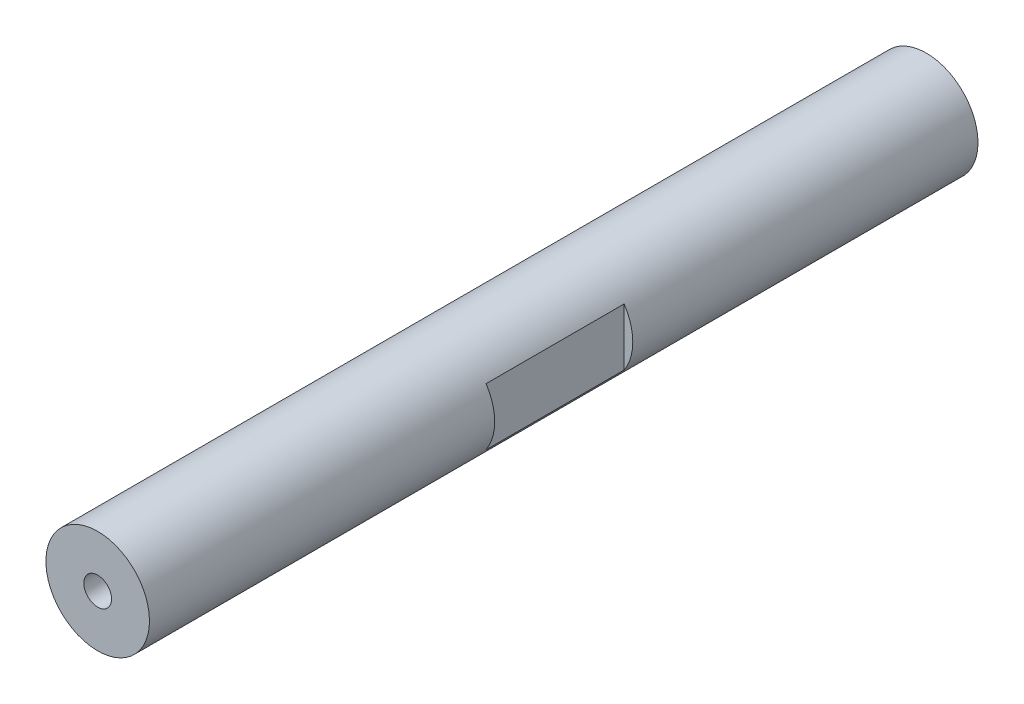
ISO-10303-21;
HEADER;
FILE_DESCRIPTION(('STEP AP214'),'2;1');
FILE_NAME('part.step','',(''),(''),'','','');
FILE_SCHEMA(('AUTOMOTIVE_DESIGN { 1 0 10303 214 1 1 1 1 }'));
ENDSEC;
DATA;
#1=APPLICATION_CONTEXT('core data for automotive mechanical design processes');
#2=APPLICATION_PROTOCOL_DEFINITION('international standard','automotive_design',2000,#1);
#3=PRODUCT_CONTEXT('',#1,'mechanical');
#4=PRODUCT('Part','Part','',(#3));
#5=PRODUCT_RELATED_PRODUCT_CATEGORY('part','',(#4));
#6=PRODUCT_DEFINITION_FORMATION('','',#4);
#7=PRODUCT_DEFINITION_CONTEXT('part definition',#1,'design');
#8=PRODUCT_DEFINITION('design','',#6,#7);
#9=PRODUCT_DEFINITION_SHAPE('','',#8);
#10=(LENGTH_UNIT() NAMED_UNIT(*) SI_UNIT(.MILLI.,.METRE.));
#11=(NAMED_UNIT(*) PLANE_ANGLE_UNIT() SI_UNIT($,.RADIAN.));
#12=(NAMED_UNIT(*) SI_UNIT($,.STERADIAN.) SOLID_ANGLE_UNIT());
#13=UNCERTAINTY_MEASURE_WITH_UNIT(LENGTH_MEASURE(1.E-05),#10,'distance_accuracy_value','');
#14=(GEOMETRIC_REPRESENTATION_CONTEXT(3) GLOBAL_UNCERTAINTY_ASSIGNED_CONTEXT((#13)) GLOBAL_UNIT_ASSIGNED_CONTEXT((#10,
#11,#12)) REPRESENTATION_CONTEXT('',''));
#15=CARTESIAN_POINT('',(0.,0.,0.));
#16=DIRECTION('',(0.,0.,1.));
#17=DIRECTION('',(1.,0.,0.));
#18=AXIS2_PLACEMENT_3D('',#15,#16,#17);
#19=CARTESIAN_POINT('',(0.,0.,76.2));
#20=DIRECTION('',(0.,0.,-1.));
#21=DIRECTION('',(-1.,0.,0.));
#22=AXIS2_PLACEMENT_3D('',#19,#20,#21);
#23=CYLINDRICAL_SURFACE('',#22,9.525);
#24=DIRECTION('',(0.,0.,-1.));
#25=VECTOR('',#24,1.);
#26=CARTESIAN_POINT('',(7.9375,5.26514185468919,76.2));
#27=LINE('',#26,#25);
#28=CARTESIAN_POINT('',(7.9375,5.26514185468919,12.7));
#29=VERTEX_POINT('',#28);
#30=CARTESIAN_POINT('',(7.9375,5.26514185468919,-12.7));
#31=VERTEX_POINT('',#30);
#32=EDGE_CURVE('E50',#29,#31,#27,.T.);
#33=ORIENTED_EDGE('',*,*,#32,.T.);
#34=CARTESIAN_POINT('',(0.,0.,-12.7));
#35=DIRECTION('',(0.,0.,-1.));
#36=DIRECTION('',(-1.,0.,0.));
#37=AXIS2_PLACEMENT_3D('',#34,#35,#36);
#38=CIRCLE('',#37,9.525);
#39=CARTESIAN_POINT('',(7.9375,-5.26514185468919,-12.7));
#40=VERTEX_POINT('',#39);
#41=EDGE_CURVE('E11',#31,#40,#38,.T.);
#42=ORIENTED_EDGE('',*,*,#41,.T.);
#43=DIRECTION('',(0.,0.,-1.));
#44=VECTOR('',#43,1.);
#45=CARTESIAN_POINT('',(7.9375,-5.26514185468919,76.2));
#46=LINE('',#45,#44);
#47=CARTESIAN_POINT('',(7.9375,-5.26514185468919,12.7));
#48=VERTEX_POINT('',#47);
#49=EDGE_CURVE('E126',#40,#48,#46,.F.);
#50=ORIENTED_EDGE('',*,*,#49,.T.);
#51=CARTESIAN_POINT('',(0.,0.,12.7));
#52=DIRECTION('',(0.,0.,1.));
#53=DIRECTION('',(1.,0.,0.));
#54=AXIS2_PLACEMENT_3D('',#51,#52,#53);
#55=CIRCLE('',#54,9.525);
#56=EDGE_CURVE('E119',#48,#29,#55,.T.);
#57=ORIENTED_EDGE('',*,*,#56,.T.);
#58=EDGE_LOOP('',(#33,#42,#50,#57));
#59=FACE_BOUND('',#58,.T.);
#60=DIRECTION('',(0.,0.,-1.));
#61=VECTOR('',#60,1.);
#62=CARTESIAN_POINT('',(-7.93749999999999,5.26514185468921,76.2));
#63=LINE('',#62,#61);
#64=CARTESIAN_POINT('',(-7.93749999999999,5.26514185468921,-12.7));
#65=VERTEX_POINT('',#64);
#66=CARTESIAN_POINT('',(-7.93749999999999,5.26514185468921,12.7));
#67=VERTEX_POINT('',#66);
#68=EDGE_CURVE('E101',#65,#67,#63,.F.);
#69=ORIENTED_EDGE('',*,*,#68,.T.);
#70=CARTESIAN_POINT('',(0.,0.,12.7));
#71=DIRECTION('',(0.,0.,1.));
#72=DIRECTION('',(1.,0.,0.));
#73=AXIS2_PLACEMENT_3D('',#70,#71,#72);
#74=CIRCLE('',#73,9.525);
#75=CARTESIAN_POINT('',(-7.93749999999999,-5.26514185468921,12.7));
#76=VERTEX_POINT('',#75);
#77=EDGE_CURVE('E114',#67,#76,#74,.T.);
#78=ORIENTED_EDGE('',*,*,#77,.T.);
#79=DIRECTION('',(0.,0.,-1.));
#80=VECTOR('',#79,1.);
#81=CARTESIAN_POINT('',(-7.93749999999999,-5.26514185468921,76.2));
#82=LINE('',#81,#80);
#83=CARTESIAN_POINT('',(-7.93749999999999,-5.26514185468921,-12.7));
#84=VERTEX_POINT('',#83);
#85=EDGE_CURVE('E107',#76,#84,#82,.T.);
#86=ORIENTED_EDGE('',*,*,#85,.T.);
#87=CARTESIAN_POINT('',(0.,0.,-12.7));
#88=DIRECTION('',(0.,0.,-1.));
#89=DIRECTION('',(-1.,0.,0.));
#90=AXIS2_PLACEMENT_3D('',#87,#88,#89);
#91=CIRCLE('',#90,9.525);
#92=EDGE_CURVE('E92',#84,#65,#91,.T.);
#93=ORIENTED_EDGE('',*,*,#92,.T.);
#94=EDGE_LOOP('',(#69,#78,#86,#93));
#95=FACE_BOUND('',#94,.T.);
#96=CARTESIAN_POINT('',(0.,0.,76.2));
#97=DIRECTION('',(0.,0.,1.));
#98=DIRECTION('',(1.,0.,0.));
#99=AXIS2_PLACEMENT_3D('',#96,#97,#98);
#100=CIRCLE('',#99,9.525);
#101=CARTESIAN_POINT('',(9.525,0.,76.2));
#102=VERTEX_POINT('',#101);
#103=EDGE_CURVE('E102',#102,#102,#100,.T.);
#104=ORIENTED_EDGE('',*,*,#103,.F.);
#105=EDGE_LOOP('',(#104));
#106=FACE_BOUND('',#105,.T.);
#107=CARTESIAN_POINT('',(0.,0.,-76.2));
#108=DIRECTION('',(0.,0.,1.));
#109=DIRECTION('',(1.,0.,0.));
#110=AXIS2_PLACEMENT_3D('',#107,#108,#109);
#111=CIRCLE('',#110,9.525);
#112=CARTESIAN_POINT('',(9.525,0.,-76.2));
#113=VERTEX_POINT('',#112);
#114=EDGE_CURVE('E165',#113,#113,#111,.T.);
#115=ORIENTED_EDGE('',*,*,#114,.T.);
#116=EDGE_LOOP('',(#115));
#117=FACE_BOUND('',#116,.T.);
#118=ADVANCED_FACE('F42',(#59,#95,#106,#117),#23,.T.);
#119=CARTESIAN_POINT('',(0.,0.,76.2));
#120=DIRECTION('',(0.,0.,1.));
#121=DIRECTION('',(1.,0.,0.));
#122=AXIS2_PLACEMENT_3D('',#119,#120,#121);
#123=PLANE('',#122);
#124=CARTESIAN_POINT('',(0.,0.,76.2));
#125=DIRECTION('',(0.,0.,1.));
#126=DIRECTION('',(1.,0.,0.));
#127=AXIS2_PLACEMENT_3D('',#124,#125,#126);
#128=CIRCLE('',#127,2.55269999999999);
#129=CARTESIAN_POINT('',(2.55269999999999,0.,76.2));
#130=VERTEX_POINT('',#129);
#131=EDGE_CURVE('E158',#130,#130,#128,.T.);
#132=ORIENTED_EDGE('',*,*,#131,.F.);
#133=EDGE_LOOP('',(#132));
#134=FACE_BOUND('',#133,.T.);
#135=ORIENTED_EDGE('',*,*,#103,.T.);
#136=EDGE_LOOP('',(#135));
#137=FACE_BOUND('',#136,.T.);
#138=ADVANCED_FACE('F177',(#134,#137),#123,.T.);
#139=CARTESIAN_POINT('',(0.,0.,-76.2));
#140=DIRECTION('',(0.,0.,1.));
#141=DIRECTION('',(1.,0.,0.));
#142=AXIS2_PLACEMENT_3D('',#139,#140,#141);
#143=PLANE('',#142);
#144=CARTESIAN_POINT('',(0.,0.,-76.2));
#145=DIRECTION('',(0.,0.,-1.));
#146=DIRECTION('',(-1.,0.,0.));
#147=AXIS2_PLACEMENT_3D('',#144,#145,#146);
#148=CIRCLE('',#147,2.55269999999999);
#149=CARTESIAN_POINT('',(-2.55269999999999,0.,-76.2));
#150=VERTEX_POINT('',#149);
#151=EDGE_CURVE('E146',#150,#150,#148,.T.);
#152=ORIENTED_EDGE('',*,*,#151,.F.);
#153=EDGE_LOOP('',(#152));
#154=FACE_BOUND('',#153,.T.);
#155=ORIENTED_EDGE('',*,*,#114,.F.);
#156=EDGE_LOOP('',(#155));
#157=FACE_BOUND('',#156,.T.);
#158=ADVANCED_FACE('F174',(#154,#157),#143,.F.);
#159=CARTESIAN_POINT('',(0.,0.,44.45));
#160=DIRECTION('',(0.,0.,1.));
#161=DIRECTION('',(1.,0.,0.));
#162=AXIS2_PLACEMENT_3D('',#159,#160,#161);
#163=CONICAL_SURFACE('',#162,2.55269999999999,1.02974425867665);
#164=CARTESIAN_POINT('',(0.,0.,42.9161830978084));
#165=VERTEX_POINT('',#164);
#166=VERTEX_LOOP('',#165);
#167=FACE_BOUND('',#166,.T.);
#168=CARTESIAN_POINT('',(0.,0.,44.45));
#169=DIRECTION('',(0.,0.,1.));
#170=DIRECTION('',(1.,0.,0.));
#171=AXIS2_PLACEMENT_3D('',#168,#169,#170);
#172=CIRCLE('',#171,2.55269999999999);
#173=CARTESIAN_POINT('',(2.55269999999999,0.,44.45));
#174=VERTEX_POINT('',#173);
#175=EDGE_CURVE('E162',#174,#174,#172,.T.);
#176=ORIENTED_EDGE('',*,*,#175,.T.);
#177=EDGE_LOOP('',(#176));
#178=FACE_BOUND('',#177,.T.);
#179=ADVANCED_FACE('F176',(#167,#178),#163,.F.);
#180=CARTESIAN_POINT('',(0.,0.,76.2));
#181=DIRECTION('',(0.,0.,1.));
#182=DIRECTION('',(1.,0.,0.));
#183=AXIS2_PLACEMENT_3D('',#180,#181,#182);
#184=CYLINDRICAL_SURFACE('',#183,2.55269999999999);
#185=ORIENTED_EDGE('',*,*,#175,.F.);
#186=EDGE_LOOP('',(#185));
#187=FACE_BOUND('',#186,.T.);
#188=ORIENTED_EDGE('',*,*,#131,.T.);
#189=EDGE_LOOP('',(#188));
#190=FACE_BOUND('',#189,.T.);
#191=ADVANCED_FACE('F183',(#187,#190),#184,.F.);
#192=CARTESIAN_POINT('',(0.,0.,-44.45));
#193=DIRECTION('',(0.,0.,-1.));
#194=DIRECTION('',(-1.,0.,0.));
#195=AXIS2_PLACEMENT_3D('',#192,#193,#194);
#196=CONICAL_SURFACE('',#195,2.55269999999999,1.02974425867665);
#197=CARTESIAN_POINT('',(0.,0.,-42.9161830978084));
#198=VERTEX_POINT('',#197);
#199=VERTEX_LOOP('',#198);
#200=FACE_BOUND('',#199,.T.);
#201=CARTESIAN_POINT('',(0.,0.,-44.45));
#202=DIRECTION('',(0.,0.,-1.));
#203=DIRECTION('',(-1.,0.,0.));
#204=AXIS2_PLACEMENT_3D('',#201,#202,#203);
#205=CIRCLE('',#204,2.55269999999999);
#206=CARTESIAN_POINT('',(-2.55269999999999,0.,-44.45));
#207=VERTEX_POINT('',#206);
#208=EDGE_CURVE('E154',#207,#207,#205,.T.);
#209=ORIENTED_EDGE('',*,*,#208,.T.);
#210=EDGE_LOOP('',(#209));
#211=FACE_BOUND('',#210,.T.);
#212=ADVANCED_FACE('F212',(#200,#211),#196,.F.);
#213=CARTESIAN_POINT('',(0.,0.,-76.2));
#214=DIRECTION('',(0.,0.,-1.));
#215=DIRECTION('',(-1.,0.,0.));
#216=AXIS2_PLACEMENT_3D('',#213,#214,#215);
#217=CYLINDRICAL_SURFACE('',#216,2.55269999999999);
#218=ORIENTED_EDGE('',*,*,#208,.F.);
#219=EDGE_LOOP('',(#218));
#220=FACE_BOUND('',#219,.T.);
#221=ORIENTED_EDGE('',*,*,#151,.T.);
#222=EDGE_LOOP('',(#221));
#223=FACE_BOUND('',#222,.T.);
#224=ADVANCED_FACE('F228',(#220,#223),#217,.F.);
#225=CARTESIAN_POINT('',(-7.93749999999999,-9.525,12.7));
#226=DIRECTION('',(1.,0.,0.));
#227=DIRECTION('',(0.,0.,-1.));
#228=AXIS2_PLACEMENT_3D('',#225,#226,#227);
#229=PLANE('',#228);
#230=DIRECTION('',(0.,1.,0.));
#231=VECTOR('',#230,1.);
#232=CARTESIAN_POINT('',(-7.93749999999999,-9.525,12.7));
#233=LINE('',#232,#231);
#234=EDGE_CURVE('E110',#76,#67,#233,.T.);
#235=ORIENTED_EDGE('',*,*,#234,.T.);
#236=ORIENTED_EDGE('',*,*,#68,.F.);
#237=DIRECTION('',(0.,1.,0.));
#238=VECTOR('',#237,1.);
#239=CARTESIAN_POINT('',(-7.93749999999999,-9.525,-12.7));
#240=LINE('',#239,#238);
#241=EDGE_CURVE('E95',#84,#65,#240,.T.);
#242=ORIENTED_EDGE('',*,*,#241,.F.);
#243=ORIENTED_EDGE('',*,*,#85,.F.);
#244=EDGE_LOOP('',(#235,#236,#242,#243));
#245=FACE_BOUND('',#244,.T.);
#246=ADVANCED_FACE('F106',(#245),#229,.F.);
#247=CARTESIAN_POINT('',(-7.93749999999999,-9.525,12.7));
#248=DIRECTION('',(0.,0.,1.));
#249=DIRECTION('',(1.,0.,0.));
#250=AXIS2_PLACEMENT_3D('',#247,#248,#249);
#251=PLANE('',#250);
#252=ORIENTED_EDGE('',*,*,#234,.F.);
#253=ORIENTED_EDGE('',*,*,#77,.F.);
#254=EDGE_LOOP('',(#252,#253));
#255=FACE_BOUND('',#254,.T.);
#256=ADVANCED_FACE('F250',(#255),#251,.F.);
#257=CARTESIAN_POINT('',(-7.93749999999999,-9.525,-12.7));
#258=DIRECTION('',(0.,0.,-1.));
#259=DIRECTION('',(-1.,0.,0.));
#260=AXIS2_PLACEMENT_3D('',#257,#258,#259);
#261=PLANE('',#260);
#262=ORIENTED_EDGE('',*,*,#92,.F.);
#263=ORIENTED_EDGE('',*,*,#241,.T.);
#264=EDGE_LOOP('',(#262,#263));
#265=FACE_BOUND('',#264,.T.);
#266=ADVANCED_FACE('F94',(#265),#261,.F.);
#267=CARTESIAN_POINT('',(7.93750000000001,-9.525,12.7));
#268=DIRECTION('',(-1.,0.,0.));
#269=DIRECTION('',(0.,0.,1.));
#270=AXIS2_PLACEMENT_3D('',#267,#268,#269);
#271=PLANE('',#270);
#272=DIRECTION('',(0.,1.,0.));
#273=VECTOR('',#272,1.);
#274=CARTESIAN_POINT('',(7.93750000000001,-9.525,12.7));
#275=LINE('',#274,#273);
#276=EDGE_CURVE('E139',#48,#29,#275,.T.);
#277=ORIENTED_EDGE('',*,*,#276,.F.);
#278=ORIENTED_EDGE('',*,*,#49,.F.);
#279=DIRECTION('',(0.,1.,0.));
#280=VECTOR('',#279,1.);
#281=CARTESIAN_POINT('',(7.93750000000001,-9.525,-12.7));
#282=LINE('',#281,#280);
#283=EDGE_CURVE('E141',#40,#31,#282,.T.);
#284=ORIENTED_EDGE('',*,*,#283,.T.);
#285=ORIENTED_EDGE('',*,*,#32,.F.);
#286=EDGE_LOOP('',(#277,#278,#284,#285));
#287=FACE_BOUND('',#286,.T.);
#288=ADVANCED_FACE('F138',(#287),#271,.F.);
#289=CARTESIAN_POINT('',(7.93750000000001,-9.525,-12.7));
#290=DIRECTION('',(0.,0.,-1.));
#291=DIRECTION('',(-1.,0.,0.));
#292=AXIS2_PLACEMENT_3D('',#289,#290,#291);
#293=PLANE('',#292);
#294=ORIENTED_EDGE('',*,*,#283,.F.);
#295=ORIENTED_EDGE('',*,*,#41,.F.);
#296=EDGE_LOOP('',(#294,#295));
#297=FACE_BOUND('',#296,.T.);
#298=ADVANCED_FACE('F276',(#297),#293,.F.);
#299=CARTESIAN_POINT('',(7.93750000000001,-9.525,12.7));
#300=DIRECTION('',(0.,0.,1.));
#301=DIRECTION('',(1.,0.,0.));
#302=AXIS2_PLACEMENT_3D('',#299,#300,#301);
#303=PLANE('',#302);
#304=ORIENTED_EDGE('',*,*,#56,.F.);
#305=ORIENTED_EDGE('',*,*,#276,.T.);
#306=EDGE_LOOP('',(#304,#305));
#307=FACE_BOUND('',#306,.T.);
#308=ADVANCED_FACE('F143',(#307),#303,.F.);
#309=CLOSED_SHELL('',(#118,#138,#158,#179,#191,#212,#224,#246,#256,#266,#288,#298,#308));
#310=MANIFOLD_SOLID_BREP('B2',#309);
#311=ADVANCED_BREP_SHAPE_REPRESENTATION('',(#18,#310),#14);
#312=SHAPE_DEFINITION_REPRESENTATION(#9,#311);
ENDSEC;
END-ISO-10303-21;
